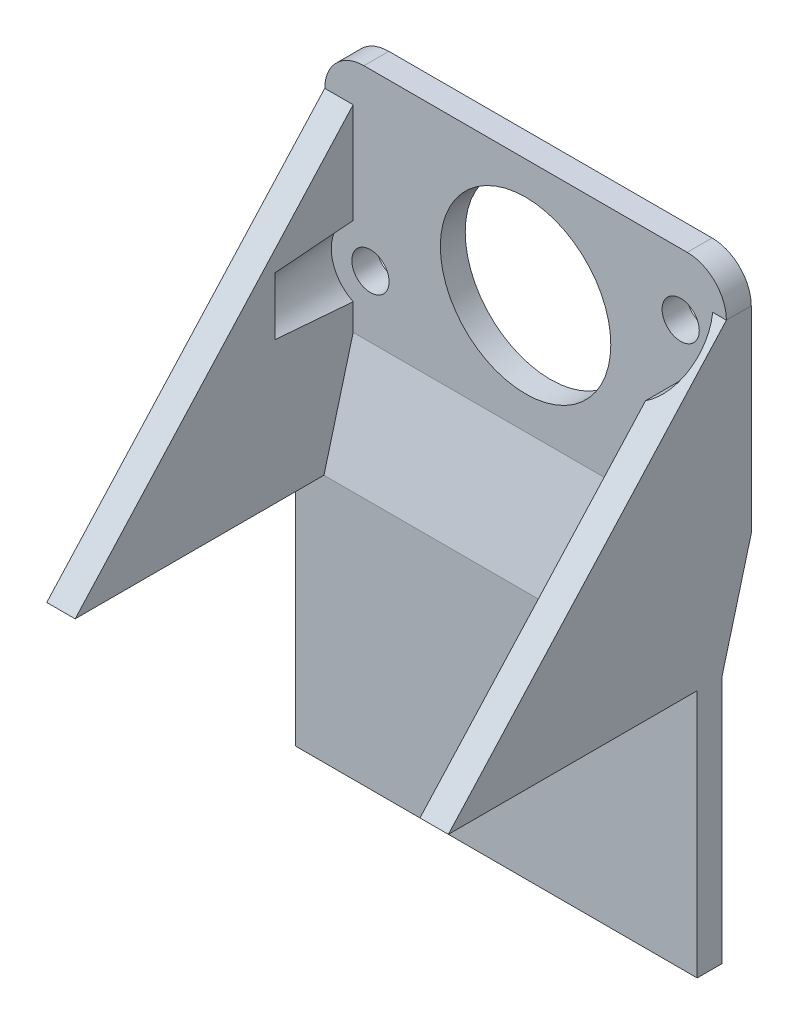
from build123d import *

# Parameters (mm, degrees)
SKETCH1_W           = 102.5
SKETCH1_H           = 60.325
SKETCH1_R           = 21.75
BOSS_EXTRUDE1_DEPTH = 6.35
FILLET1_R           = 10
SKETCH2_R           = 4.75
CUT_EXTRUDE1_DEPTH  = 6.35
BOSS_EXTRUDE4_DEPTH = 51.25
BOSS_EXTRUDE5_DEPTH = 40
CUT_EXTRUDE3_DEPTH  = 32.5
BOSS_EXTRUDE7_DEPTH = 51.25
CUT_EXTRUDE5_DEPTH  = 44
CUT_EXTRUDE6_REACH  = 151.742
SKETCH16_R          = 10
SKETCH17_R          = 10
CUT_EXTRUDE7_DEPTH  = 20
CUT_EXTRUDE7_TAPER  = 4


with BuildPart() as part:
    # Sketch1 → Boss-Extrude1 (new body)
    with BuildSketch(Plane.XY):
        Rectangle(SKETCH1_W, SKETCH1_H)
        Circle(SKETCH1_R, mode=Mode.SUBTRACT)
    extrude(amount=BOSS_EXTRUDE1_DEPTH)

    # Fillet1
    fillet1_edges = [part.edges().sort_by_distance(p)[0] for p in [
        (51.25, 30.1625, 3.175),
        (-51.25, 30.1625, 3.175),
    ]]
    fillet(fillet1_edges, radius=FILLET1_R)

    # Sketch2 → Cut-Extrude1 (cut)
    with BuildSketch(Plane.XY):
        with Locations((-39.584551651, -14.407598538)):
            Circle(SKETCH2_R)
        with Locations((39.584551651, 14.407598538)):
            Circle(SKETCH2_R)
    extrude(amount=CUT_EXTRUDE1_DEPTH, mode=Mode.SUBTRACT)

    # Sketch7 → Boss-Extrude4 (add, symmetric)
    with BuildSketch(Plane(origin=(0, 0, 0), x_dir=(0, 0, -1), z_dir=(1, 0, 0))):
        Polygon((-6.35, -30.1625), (0, -30.1625), (-7.45, -58), (-7.45, -121.5), (-13.8, -121.5), (-13.8, -58), align=None)
    extrude(amount=BOSS_EXTRUDE4_DEPTH, both=True)

    # Sketch8 → Boss-Extrude5 (add, symmetric)
    with BuildSketch(Plane(origin=(0, 0, 0), x_dir=(0, 0, -1), z_dir=(1, 0, 0))):
        Polygon((-7.45, -121.5), (0, -30.1625), (-7.45, -58), align=None)
    extrude(amount=BOSS_EXTRUDE5_DEPTH, both=True)

    # Sketch9 → Cut-Extrude3 (cut, symmetric)
    with BuildSketch(Plane.ZY):
        Polygon((7.45, -121.5), (0, -30.1625), (7.45, -58), align=None)
    extrude(amount=CUT_EXTRUDE3_DEPTH, both=True, mode=Mode.SUBTRACT)

    # Sketch13 → Boss-Extrude7 (add, symmetric)
    with BuildSketch(Plane(origin=(0, 0, 0), x_dir=(0, 0, -1), z_dir=(1, 0, 0))):
        Polygon((-77.3, -58), (-13.8, -58), (-6.35, -30.1625), (-6.35, 20.1625), align=None)
    extrude(amount=BOSS_EXTRUDE7_DEPTH, both=True)

    # Sketch15 → Cut-Extrude5 (cut, symmetric)
    with BuildSketch(Plane(origin=(0, 0, 0), x_dir=(0, 0, -1), z_dir=(1, 0, 0))):
        Polygon((-6.35, -30.1625), (-13.8, -58), (-77.3, -58), (-6.35, 30.1625), align=None)
    extrude(amount=CUT_EXTRUDE5_DEPTH, both=True, mode=Mode.SUBTRACT)

    # Cut-Extrude6: up to this face of the body (flat: up to its plane)
    cut_extrude6_end = Plane(part.part.faces().sort_by_distance((47.625, -18.91875, 41.825))[0])
    # Sketch16 → Cut-Extrude6 (cut, up to the picked face)
    with BuildSketch(Plane.XY.offset(6.35), mode=Mode.PRIVATE) as cut_extrude6_sk1:
        with Locations((39.584551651, 14.407598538)):
            Circle(SKETCH16_R)
    cut_extrude6_tool1 = split(extrude(cut_extrude6_sk1.sketch, amount=CUT_EXTRUDE6_REACH, mode=Mode.PRIVATE), bisect_by=cut_extrude6_end, keep=Keep.BOTH, mode=Mode.PRIVATE)
    add(cut_extrude6_tool1.solids().sort_by(Axis((39.584552, 14.407599, 6.35), (0, 0, 1)))[0], mode=Mode.SUBTRACT)

    # Sketch17 → Cut-Extrude7 (cut)
    with BuildSketch(Plane.XY.offset(6.35)):
        with Locations((-39.584551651, -14.407598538)):
            Circle(SKETCH17_R)
    extrude(amount=CUT_EXTRUDE7_DEPTH, taper=CUT_EXTRUDE7_TAPER, mode=Mode.SUBTRACT)


solid = part.part
